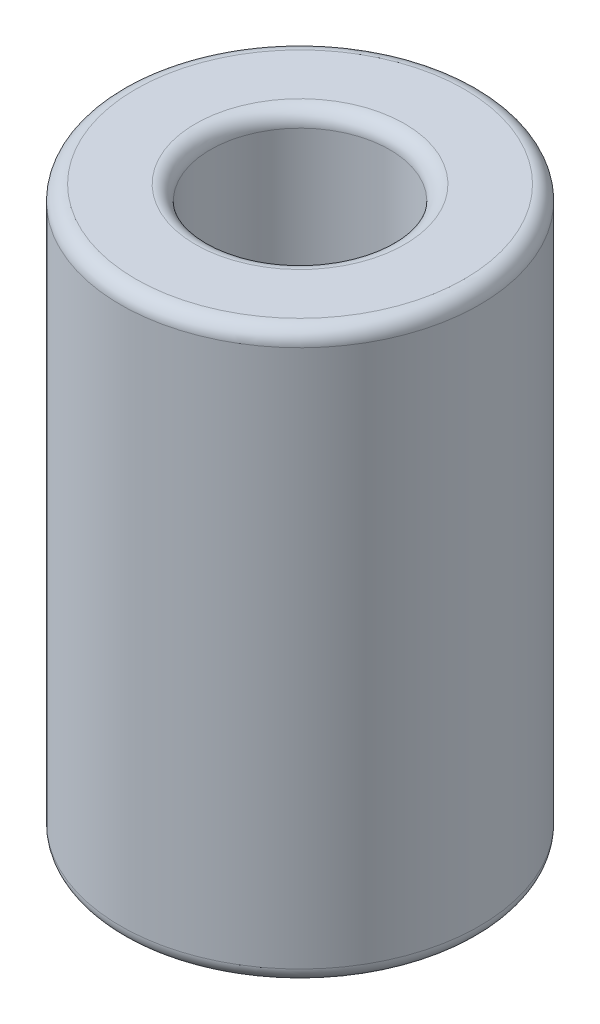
ISO-10303-21;
HEADER;
FILE_DESCRIPTION(('STEP AP214'),'2;1');
FILE_NAME('part.step','',(''),(''),'','','');
FILE_SCHEMA(('AUTOMOTIVE_DESIGN { 1 0 10303 214 1 1 1 1 }'));
ENDSEC;
DATA;
#1=APPLICATION_CONTEXT('core data for automotive mechanical design processes');
#2=APPLICATION_PROTOCOL_DEFINITION('international standard','automotive_design',2000,#1);
#3=PRODUCT_CONTEXT('',#1,'mechanical');
#4=PRODUCT('Part','Part','',(#3));
#5=PRODUCT_RELATED_PRODUCT_CATEGORY('part','',(#4));
#6=PRODUCT_DEFINITION_FORMATION('','',#4);
#7=PRODUCT_DEFINITION_CONTEXT('part definition',#1,'design');
#8=PRODUCT_DEFINITION('design','',#6,#7);
#9=PRODUCT_DEFINITION_SHAPE('','',#8);
#10=(LENGTH_UNIT() NAMED_UNIT(*) SI_UNIT(.MILLI.,.METRE.));
#11=(NAMED_UNIT(*) PLANE_ANGLE_UNIT() SI_UNIT($,.RADIAN.));
#12=(NAMED_UNIT(*) SI_UNIT($,.STERADIAN.) SOLID_ANGLE_UNIT());
#13=UNCERTAINTY_MEASURE_WITH_UNIT(LENGTH_MEASURE(1.E-05),#10,'distance_accuracy_value','');
#14=(GEOMETRIC_REPRESENTATION_CONTEXT(3) GLOBAL_UNCERTAINTY_ASSIGNED_CONTEXT((#13)) GLOBAL_UNIT_ASSIGNED_CONTEXT((#10,
#11,#12)) REPRESENTATION_CONTEXT('',''));
#15=CARTESIAN_POINT('',(0.,0.,0.));
#16=DIRECTION('',(0.,0.,1.));
#17=DIRECTION('',(1.,0.,0.));
#18=AXIS2_PLACEMENT_3D('',#15,#16,#17);
#19=CARTESIAN_POINT('',(0.,19.,0.));
#20=DIRECTION('',(0.,-1.,0.));
#21=DIRECTION('',(0.,0.,-1.));
#22=AXIS2_PLACEMENT_3D('',#19,#20,#21);
#23=CYLINDRICAL_SURFACE('',#22,3.);
#24=CARTESIAN_POINT('',(0.,18.5,0.));
#25=DIRECTION('',(0.,1.,0.));
#26=DIRECTION('',(0.,0.,1.));
#27=AXIS2_PLACEMENT_3D('',#24,#25,#26);
#28=CIRCLE('',#27,3.);
#29=CARTESIAN_POINT('',(0.,18.5,3.));
#30=VERTEX_POINT('',#29);
#31=EDGE_CURVE('E217',#30,#30,#28,.F.);
#32=ORIENTED_EDGE('',*,*,#31,.F.);
#33=EDGE_LOOP('',(#32));
#34=FACE_BOUND('',#33,.T.);
#35=CARTESIAN_POINT('',(0.,0.5,0.));
#36=DIRECTION('',(0.,1.,0.));
#37=DIRECTION('',(0.,0.,1.));
#38=AXIS2_PLACEMENT_3D('',#35,#36,#37);
#39=CIRCLE('',#38,3.);
#40=CARTESIAN_POINT('',(0.,0.5,3.));
#41=VERTEX_POINT('',#40);
#42=EDGE_CURVE('E68',#41,#41,#39,.T.);
#43=ORIENTED_EDGE('',*,*,#42,.F.);
#44=EDGE_LOOP('',(#43));
#45=FACE_BOUND('',#44,.T.);
#46=ADVANCED_FACE('F17',(#34,#45),#23,.F.);
#47=CARTESIAN_POINT('',(0.,18.5,0.));
#48=DIRECTION('',(0.,1.,0.));
#49=DIRECTION('',(0.,0.,1.));
#50=AXIS2_PLACEMENT_3D('',#47,#48,#49);
#51=TOROIDAL_SURFACE('',#50,3.5,0.5);
#52=ORIENTED_EDGE('',*,*,#31,.T.);
#53=EDGE_LOOP('',(#52));
#54=FACE_BOUND('',#53,.T.);
#55=CARTESIAN_POINT('',(0.,19.,0.));
#56=DIRECTION('',(0.,1.,0.));
#57=DIRECTION('',(0.,0.,1.));
#58=AXIS2_PLACEMENT_3D('',#55,#56,#57);
#59=CIRCLE('',#58,3.5);
#60=CARTESIAN_POINT('',(0.,19.,-3.5));
#61=VERTEX_POINT('',#60);
#62=CARTESIAN_POINT('',(0.,19.,3.5));
#63=VERTEX_POINT('',#62);
#64=EDGE_CURVE('E58',#61,#63,#59,.F.);
#65=ORIENTED_EDGE('',*,*,#64,.F.);
#66=CARTESIAN_POINT('',(0.,19.,0.));
#67=DIRECTION('',(0.,1.,0.));
#68=DIRECTION('',(0.,0.,-1.));
#69=AXIS2_PLACEMENT_3D('',#66,#67,#68);
#70=CIRCLE('',#69,3.5);
#71=EDGE_CURVE('E56',#63,#61,#70,.F.);
#72=ORIENTED_EDGE('',*,*,#71,.F.);
#73=EDGE_LOOP('',(#65,#72));
#74=FACE_BOUND('',#73,.T.);
#75=ADVANCED_FACE('F60',(#54,#74),#51,.T.);
#76=CARTESIAN_POINT('',(0.,0.5,0.));
#77=DIRECTION('',(0.,1.,0.));
#78=DIRECTION('',(0.,0.,1.));
#79=AXIS2_PLACEMENT_3D('',#76,#77,#78);
#80=TOROIDAL_SURFACE('',#79,3.5,0.5);
#81=CARTESIAN_POINT('',(0.,0.,0.));
#82=DIRECTION('',(0.,-1.,0.));
#83=DIRECTION('',(0.,0.,1.));
#84=AXIS2_PLACEMENT_3D('',#81,#82,#83);
#85=CIRCLE('',#84,3.5);
#86=CARTESIAN_POINT('',(0.,0.,3.5));
#87=VERTEX_POINT('',#86);
#88=CARTESIAN_POINT('',(0.,0.,-3.5));
#89=VERTEX_POINT('',#88);
#90=EDGE_CURVE('E63',#87,#89,#85,.T.);
#91=ORIENTED_EDGE('',*,*,#90,.T.);
#92=CARTESIAN_POINT('',(0.,0.,0.));
#93=DIRECTION('',(0.,-1.,0.));
#94=DIRECTION('',(0.,0.,-1.));
#95=AXIS2_PLACEMENT_3D('',#92,#93,#94);
#96=CIRCLE('',#95,3.5);
#97=EDGE_CURVE('E158',#89,#87,#96,.T.);
#98=ORIENTED_EDGE('',*,*,#97,.T.);
#99=EDGE_LOOP('',(#91,#98));
#100=FACE_BOUND('',#99,.T.);
#101=ORIENTED_EDGE('',*,*,#42,.T.);
#102=EDGE_LOOP('',(#101));
#103=FACE_BOUND('',#102,.T.);
#104=ADVANCED_FACE('F89',(#100,#103),#80,.T.);
#105=CARTESIAN_POINT('',(0.,19.,0.));
#106=DIRECTION('',(0.,1.,0.));
#107=DIRECTION('',(0.,0.,1.));
#108=AXIS2_PLACEMENT_3D('',#105,#106,#107);
#109=PLANE('',#108);
#110=CARTESIAN_POINT('',(0.,19.,0.));
#111=DIRECTION('',(0.,-1.,0.));
#112=DIRECTION('',(0.,0.,-1.));
#113=AXIS2_PLACEMENT_3D('',#110,#111,#112);
#114=CIRCLE('',#113,5.5);
#115=CARTESIAN_POINT('',(0.,19.,-5.5));
#116=VERTEX_POINT('',#115);
#117=CARTESIAN_POINT('',(0.,19.,5.5));
#118=VERTEX_POINT('',#117);
#119=EDGE_CURVE('E124',#116,#118,#114,.T.);
#120=ORIENTED_EDGE('',*,*,#119,.F.);
#121=CARTESIAN_POINT('',(0.,19.,0.));
#122=DIRECTION('',(0.,-1.,0.));
#123=DIRECTION('',(0.,0.,1.));
#124=AXIS2_PLACEMENT_3D('',#121,#122,#123);
#125=CIRCLE('',#124,5.5);
#126=EDGE_CURVE('E112',#118,#116,#125,.T.);
#127=ORIENTED_EDGE('',*,*,#126,.F.);
#128=EDGE_LOOP('',(#120,#127));
#129=FACE_BOUND('',#128,.T.);
#130=ORIENTED_EDGE('',*,*,#71,.T.);
#131=ORIENTED_EDGE('',*,*,#64,.T.);
#132=EDGE_LOOP('',(#130,#131));
#133=FACE_BOUND('',#132,.T.);
#134=ADVANCED_FACE('F67',(#129,#133),#109,.T.);
#135=CARTESIAN_POINT('',(0.,0.,0.));
#136=DIRECTION('',(0.,1.,0.));
#137=DIRECTION('',(0.,0.,1.));
#138=AXIS2_PLACEMENT_3D('',#135,#136,#137);
#139=PLANE('',#138);
#140=CARTESIAN_POINT('',(0.,0.,0.));
#141=DIRECTION('',(0.,1.,0.));
#142=DIRECTION('',(0.,0.,1.));
#143=AXIS2_PLACEMENT_3D('',#140,#141,#142);
#144=CIRCLE('',#143,5.5);
#145=CARTESIAN_POINT('',(0.,0.,5.5));
#146=VERTEX_POINT('',#145);
#147=CARTESIAN_POINT('',(0.,0.,-5.5));
#148=VERTEX_POINT('',#147);
#149=EDGE_CURVE('E168',#146,#148,#144,.T.);
#150=ORIENTED_EDGE('',*,*,#149,.F.);
#151=CARTESIAN_POINT('',(0.,0.,0.));
#152=DIRECTION('',(0.,1.,0.));
#153=DIRECTION('',(0.,0.,-1.));
#154=AXIS2_PLACEMENT_3D('',#151,#152,#153);
#155=CIRCLE('',#154,5.5);
#156=EDGE_CURVE('E35',#148,#146,#155,.T.);
#157=ORIENTED_EDGE('',*,*,#156,.F.);
#158=EDGE_LOOP('',(#150,#157));
#159=FACE_BOUND('',#158,.T.);
#160=ORIENTED_EDGE('',*,*,#90,.F.);
#161=ORIENTED_EDGE('',*,*,#97,.F.);
#162=EDGE_LOOP('',(#160,#161));
#163=FACE_BOUND('',#162,.T.);
#164=ADVANCED_FACE('F88',(#159,#163),#139,.F.);
#165=CARTESIAN_POINT('',(0.,18.5,0.));
#166=DIRECTION('',(0.,1.,0.));
#167=DIRECTION('',(0.,0.,1.));
#168=AXIS2_PLACEMENT_3D('',#165,#166,#167);
#169=TOROIDAL_SURFACE('',#168,5.5,0.5);
#170=ORIENTED_EDGE('',*,*,#126,.T.);
#171=ORIENTED_EDGE('',*,*,#119,.T.);
#172=EDGE_LOOP('',(#170,#171));
#173=FACE_BOUND('',#172,.T.);
#174=CARTESIAN_POINT('',(0.,18.5,0.));
#175=DIRECTION('',(0.,-1.,0.));
#176=DIRECTION('',(0.,0.,-1.));
#177=AXIS2_PLACEMENT_3D('',#174,#175,#176);
#178=CIRCLE('',#177,6.);
#179=CARTESIAN_POINT('',(0.,18.5,-6.));
#180=VERTEX_POINT('',#179);
#181=EDGE_CURVE('E27',#180,#180,#178,.T.);
#182=ORIENTED_EDGE('',*,*,#181,.F.);
#183=EDGE_LOOP('',(#182));
#184=FACE_BOUND('',#183,.T.);
#185=ADVANCED_FACE('F128',(#173,#184),#169,.T.);
#186=CARTESIAN_POINT('',(0.,0.5,0.));
#187=DIRECTION('',(0.,1.,0.));
#188=DIRECTION('',(0.,0.,1.));
#189=AXIS2_PLACEMENT_3D('',#186,#187,#188);
#190=TOROIDAL_SURFACE('',#189,5.5,0.5);
#191=CARTESIAN_POINT('',(0.,0.5,0.));
#192=DIRECTION('',(0.,-1.,0.));
#193=DIRECTION('',(0.,0.,-1.));
#194=AXIS2_PLACEMENT_3D('',#191,#192,#193);
#195=CIRCLE('',#194,6.);
#196=CARTESIAN_POINT('',(0.,0.5,-6.));
#197=VERTEX_POINT('',#196);
#198=EDGE_CURVE('E11',#197,#197,#195,.F.);
#199=ORIENTED_EDGE('',*,*,#198,.F.);
#200=EDGE_LOOP('',(#199));
#201=FACE_BOUND('',#200,.T.);
#202=ORIENTED_EDGE('',*,*,#149,.T.);
#203=ORIENTED_EDGE('',*,*,#156,.T.);
#204=EDGE_LOOP('',(#202,#203));
#205=FACE_BOUND('',#204,.T.);
#206=ADVANCED_FACE('F137',(#201,#205),#190,.T.);
#207=CARTESIAN_POINT('',(0.,19.,0.));
#208=DIRECTION('',(0.,-1.,0.));
#209=DIRECTION('',(0.,0.,-1.));
#210=AXIS2_PLACEMENT_3D('',#207,#208,#209);
#211=CYLINDRICAL_SURFACE('',#210,6.);
#212=ORIENTED_EDGE('',*,*,#198,.T.);
#213=EDGE_LOOP('',(#212));
#214=FACE_BOUND('',#213,.T.);
#215=ORIENTED_EDGE('',*,*,#181,.T.);
#216=EDGE_LOOP('',(#215));
#217=FACE_BOUND('',#216,.T.);
#218=ADVANCED_FACE('F248',(#214,#217),#211,.T.);
#219=CLOSED_SHELL('',(#46,#75,#104,#134,#164,#185,#206,#218));
#220=MANIFOLD_SOLID_BREP('B1',#219);
#221=ADVANCED_BREP_SHAPE_REPRESENTATION('',(#18,#220),#14);
#222=SHAPE_DEFINITION_REPRESENTATION(#9,#221);
ENDSEC;
END-ISO-10303-21;
